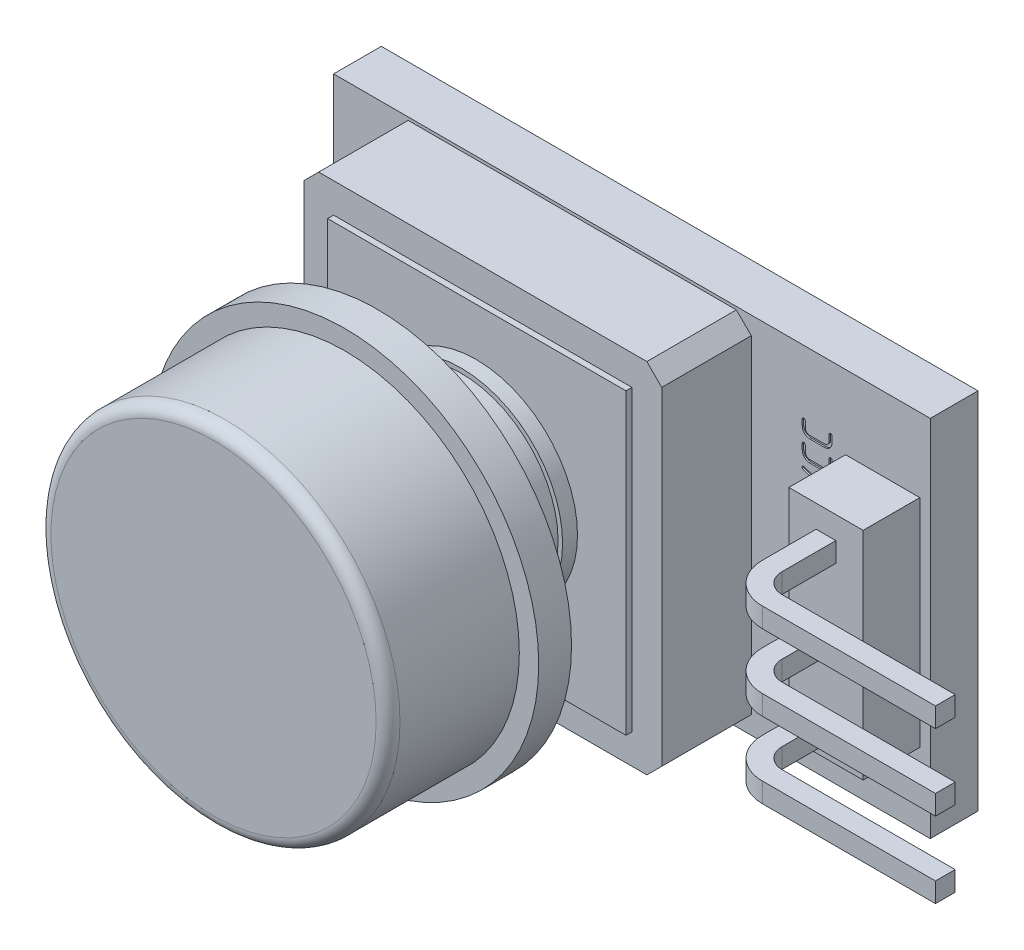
from build123d import *

# Parameters (mm, degrees)
SKETCH1_W           = 20
SKETCH1_H           = 12.2
BOSS_EXTRUDE1_DEPTH = 1.6
SKETCH5_W           = 2.49
SKETCH5_H           = 7.25
BOSS_EXTRUDE3_DEPTH = 1.9
EXTRUDE_THIN1_DEPTH = 0.33
LPATTERN1_COUNT     = 2
LPATTERN1_PITCH     = 2.54
LPATTERN1_2_COUNT   = 2
LPATTERN1_2_PITCH   = 2.54
CUT_EXTRUDE3_DEPTH  = 0.05
BOSS_EXTRU_1_DEPTH  = 3
ESQUISSE2_W         = 10
ESQUISSE2_H         = 10
BOSS_EXTRU_2_DEPTH  = 0.2
ESQUISSE3_R         = 3.4
BOSS_EXTRU_3_DEPTH  = 0.5
ESQUISSE5_W         = 1.960547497
ESQUISSE5_H         = 1.176328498
BOSS_EXTRU_4_DEPTH  = 0.5
BOSS_EXTRU_5_DEPTH  = 0.1


with BuildPart() as part:
    # Sketch1 → Boss-Extrude1 (new body)
    with BuildSketch(Plane.XY):
        with Locations((-3, 0)):
            Rectangle(SKETCH1_W, SKETCH1_H)
    extrude(amount=-BOSS_EXTRUDE1_DEPTH)

    # Sketch14 → Cut-Extrude3 (cut)
    # profile 1 of 9: a face of its own
    with BuildSketch(Plane.XY):
        with BuildLine():
            add(Edge.make_bspline(
                [(3.009027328, -3.554935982), (2.998579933, -3.555520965), (2.978074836, -3.55666911), (2.948035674, -3.561097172), (2.919420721, -3.568303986), (2.892009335, -3.577828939), (2.865997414, -3.590032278), (2.841346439, -3.604814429), (2.81815031, -3.622212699), (2.79635941, -3.641775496), (2.776440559, -3.663190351), (2.759145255, -3.686301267), (2.744161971, -3.710620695), (2.731743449, -3.736280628), (2.721883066, -3.763307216), (2.71490563, -3.791671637), (2.710019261, -3.821307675), (2.709092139, -3.84156936), (2.70862003, -3.851887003)],
                knots=[0, 0, 0, 0, 1.071120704, 2.10228816, 3.103427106, 4.088573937, 5.069289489, 6.04014042, 7.026654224, 8.033736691, 9.035236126, 10.016197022, 10.984715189, 11.955888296, 12.930301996, 13.924712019, 14.943223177, 16, 16, 16, 16], degree=3))
            add(Edge.make_bspline(
                [(2.70862003, -3.851887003), (2.709096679, -3.86220393), (2.710035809, -3.882531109), (2.714879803, -3.912242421), (2.7218881, -3.94066801), (2.731733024, -3.967702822), (2.7442239, -3.99338595), (2.759071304, -4.017858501), (2.776506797, -4.041001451), (2.796352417, -4.062600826), (2.818088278, -4.082378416), (2.841354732, -4.099759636), (2.865989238, -4.114575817), (2.892054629, -4.12669524), (2.91937203, -4.136568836), (2.948063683, -4.143594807), (2.978043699, -4.148450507), (2.998573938, -4.149380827), (3.009026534, -4.149854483)],
                knots=[0, 0, 0, 0, 1.055102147, 2.078840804, 3.071674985, 4.044544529, 5.014178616, 5.987072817, 6.966479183, 7.971488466, 8.981616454, 9.966566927, 10.935879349, 11.915040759, 12.900940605, 13.900493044, 14.931074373, 16, 16, 16, 16], degree=3))
            Line((3.009026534, -4.149854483), (3.407536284, -4.149821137))
            add(Edge.make_bspline(
                [(3.407536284, -4.149821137), (3.417875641, -4.149358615), (3.438225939, -4.148448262), (3.467962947, -4.143603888), (3.49649459, -4.13651489), (3.523682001, -4.126810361), (3.549535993, -4.114401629), (3.574229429, -4.099831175), (3.597512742, -4.082433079), (3.619060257, -4.062530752), (3.638916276, -4.041012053), (3.656322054, -4.017848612), (3.671228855, -3.993439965), (3.683442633, -3.967650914), (3.693273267, -3.940642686), (3.700595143, -3.912275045), (3.705357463, -3.882526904), (3.706308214, -3.862202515), (3.706790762, -3.851887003)],
                knots=[0, 0, 0, 0, 1.059849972, 2.086035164, 3.081242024, 4.069497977, 5.038444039, 6.016033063, 7.003337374, 8.010748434, 9.018159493, 9.999906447, 10.975125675, 11.944071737, 12.919266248, 13.916191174, 14.942376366, 16, 16, 16, 16], degree=3))
            add(Edge.make_bspline(
                [(3.706790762, -3.851887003), (3.706312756, -3.841570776), (3.705374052, -3.821311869), (3.700568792, -3.791639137), (3.693278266, -3.763332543), (3.683432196, -3.736332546), (3.671290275, -3.710566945), (3.656248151, -3.686311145), (3.638982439, -3.663179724), (3.619054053, -3.64184549), (3.597450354, -3.622157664), (3.574237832, -3.604742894), (3.54952781, -3.590206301), (3.523726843, -3.577715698), (3.496446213, -3.568354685), (3.467990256, -3.561099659), (3.438157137, -3.556620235), (3.417780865, -3.55563894), (3.407400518, -3.555139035)],
                knots=[0, 0, 0, 0, 1.059029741, 2.079712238, 3.077962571, 4.054453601, 5.024687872, 5.9952708, 6.978322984, 7.981957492, 8.986025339, 9.974642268, 10.953530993, 11.923765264, 12.911012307, 13.90754229, 14.934032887, 16, 16, 16, 16], degree=3))
            Line((3.407400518, -3.555139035), (3.009027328, -3.554935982))
        make_face()
        with BuildLine():
            add(Edge.make_bspline(
                [(3.407536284, -3.65493618), (3.414340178, -3.655400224), (3.427769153, -3.656316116), (3.447499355, -3.659012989), (3.466427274, -3.66376125), (3.484403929, -3.670301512), (3.501717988, -3.678209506), (3.517990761, -3.688073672), (3.53349917, -3.699504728), (3.548024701, -3.712398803), (3.561250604, -3.726609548), (3.572835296, -3.74189736), (3.5829054, -3.758059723), (3.591243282, -3.775140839), (3.597817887, -3.793122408), (3.602339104, -3.811969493), (3.605828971, -3.831576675), (3.606465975, -3.845028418), (3.606790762, -3.851887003)],
                knots=[0, 0, 0, 0, 1.05399557, 2.080290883, 3.073351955, 4.063759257, 5.033579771, 6.010553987, 6.99913269, 8.007915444, 9.008238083, 9.994706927, 10.968195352, 11.947019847, 12.927579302, 13.920640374, 14.939805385, 16, 16, 16, 16], degree=3))
            add(Edge.make_bspline(
                [(3.606790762, -3.851887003), (3.606465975, -3.858745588), (3.605828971, -3.872197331), (3.602339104, -3.891804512), (3.597817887, -3.910651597), (3.591243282, -3.928633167), (3.5829054, -3.945714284), (3.572835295, -3.961876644), (3.561250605, -3.977164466), (3.548024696, -3.991375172), (3.533499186, -4.004269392), (3.517990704, -4.015699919), (3.501718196, -4.025566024), (3.484403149, -4.0334668), (3.466430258, -4.040034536), (3.447478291, -4.04468078), (3.42775388, -4.04779033), (3.414254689, -4.048485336), (3.407400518, -4.048838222)],
                knots=[0, 0, 0, 0, 1.059681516, 2.078353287, 3.070933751, 4.051018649, 5.029369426, 6.002386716, 6.988378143, 7.98821666, 8.996511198, 9.984611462, 10.961112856, 11.93046401, 12.920391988, 13.912972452, 14.940318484, 16, 16, 16, 16], degree=3))
            Line((3.407400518, -4.048838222), (3.009027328, -4.048668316))
            add(Edge.make_bspline(
                [(3.009027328, -4.048668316), (3.002104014, -4.048387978), (2.98846393, -4.047835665), (2.968547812, -4.044661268), (2.94944136, -4.040081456), (2.93137189, -4.033410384), (2.913933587, -4.025628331), (2.897636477, -4.01568187), (2.882117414, -4.00434167), (2.867804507, -3.991291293), (2.854533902, -3.977242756), (2.843221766, -3.961799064), (2.833080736, -3.945770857), (2.824954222, -3.928623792), (2.818733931, -3.910577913), (2.813736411, -3.891865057), (2.810690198, -3.872169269), (2.809992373, -3.858739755), (2.80963629, -3.851887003)],
                knots=[0, 0, 0, 0, 1.068353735, 2.1048349, 3.106403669, 4.095177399, 5.07289061, 6.048253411, 7.035201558, 8.034530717, 9.033203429, 10.011754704, 10.983637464, 11.956307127, 12.931725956, 13.925736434, 14.941554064, 16, 16, 16, 16], degree=3))
            add(Edge.make_bspline(
                [(2.80963629, -3.851887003), (2.809992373, -3.845034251), (2.810690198, -3.831604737), (2.813736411, -3.811908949), (2.818733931, -3.793196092), (2.824954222, -3.775150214), (2.833080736, -3.758003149), (2.843221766, -3.74197494), (2.854533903, -3.726531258), (2.867804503, -3.712482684), (2.882117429, -3.699432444), (2.897636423, -3.68809174), (2.913933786, -3.678147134), (2.931371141, -3.670358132), (2.949444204, -3.663713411), (2.968527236, -3.659034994), (2.988490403, -3.656254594), (3.002107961, -3.655514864), (3.009026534, -3.655139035)],
                knots=[0, 0, 0, 0, 1.058512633, 2.074394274, 3.068467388, 4.043947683, 5.016678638, 5.98862264, 6.967235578, 7.965971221, 8.965363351, 9.95237369, 10.927797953, 11.905572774, 12.894408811, 13.896040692, 14.9310569, 16, 16, 16, 16], degree=3))
            Line((3.009026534, -3.655139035), (3.407536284, -3.65493618))
        make_face(mode=Mode.SUBTRACT)
    # profile 2 of 9: a face of its own
    with BuildSketch(Plane.XY):
        with BuildLine():
            add(Edge.make_bspline(
                [(2.758283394, -2.748431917), (2.754791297, -2.748731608), (2.748069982, -2.749308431), (2.738425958, -2.751896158), (2.730002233, -2.756587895), (2.722411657, -2.762446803), (2.716063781, -2.769712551), (2.711615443, -2.778239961), (2.708539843, -2.78765707), (2.708191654, -2.794340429), (2.708010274, -2.797821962)],
                knots=[0, 0, 0, 0, 1.072902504, 2.065038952, 3.030772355, 4.00649063, 4.992529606, 5.958263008, 6.936406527, 8, 8, 8, 8], degree=3))
            add(Edge.make_bspline(
                [(2.708010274, -2.797821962), (2.708206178, -2.801300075), (2.708589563, -2.808106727), (2.711571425, -2.817745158), (2.716047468, -2.826546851), (2.722476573, -2.833969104), (2.729861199, -2.84032898), (2.73847856, -2.844890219), (2.74800401, -2.84782315), (2.754736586, -2.848358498), (2.758213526, -2.84863497)],
                knots=[0, 0, 0, 0, 1.050622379, 2.056063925, 3.028133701, 4.017773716, 5.00741373, 5.961369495, 6.947179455, 8, 8, 8, 8], degree=3))
            Line((2.758213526, -2.84863497), (3.407224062, -2.848432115))
            add(Edge.make_bspline(
                [(3.407224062, -2.848432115), (3.414064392, -2.848894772), (3.427530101, -2.849805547), (3.447296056, -2.852509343), (3.466224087, -2.857257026), (3.484200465, -2.863797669), (3.501515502, -2.871704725), (3.517784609, -2.881572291), (3.533306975, -2.892990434), (3.547813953, -2.905964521), (3.561264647, -2.920030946), (3.572810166, -2.935410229), (3.582948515, -2.951500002), (3.59100796, -2.968689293), (3.597567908, -2.986643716), (3.602402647, -3.005432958), (3.605811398, -3.02507682), (3.606460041, -3.038525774), (3.606790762, -3.045382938)],
                knots=[0, 0, 0, 0, 1.058877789, 2.084481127, 3.076872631, 4.066612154, 5.03577877, 6.012094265, 7.000006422, 8.008109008, 9.01490717, 10.000710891, 10.973542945, 11.947162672, 12.927060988, 13.922042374, 14.940520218, 16, 16, 16, 16], degree=3))
            add(Edge.make_bspline(
                [(3.606790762, -3.045382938), (3.606460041, -3.052240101), (3.605811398, -3.065689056), (3.602402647, -3.085332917), (3.597567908, -3.104122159), (3.59100796, -3.122076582), (3.582948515, -3.139265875), (3.572810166, -3.155355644), (3.561264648, -3.170734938), (3.547813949, -3.184801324), (3.533306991, -3.197775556), (3.517784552, -3.209193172), (3.50151571, -3.219062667), (3.484199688, -3.226962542), (3.466227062, -3.233530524), (3.447275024, -3.2381767), (3.427550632, -3.241286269), (3.414051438, -3.241981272), (3.407197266, -3.242334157)],
                knots=[0, 0, 0, 0, 1.059337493, 2.077678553, 3.072526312, 4.052293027, 5.025781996, 5.998483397, 6.984154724, 7.990817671, 8.998784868, 9.986564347, 10.962748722, 11.931785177, 12.921391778, 13.913650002, 14.940662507, 16, 16, 16, 16], degree=3))
            Line((3.407197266, -3.242334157), (2.758283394, -3.242164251))
            add(Edge.make_bspline(
                [(2.758283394, -3.242164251), (2.754782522, -3.242424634), (2.748024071, -3.242927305), (2.738478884, -3.245877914), (2.729860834, -3.250436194), (2.722477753, -3.256797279), (2.716043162, -3.264217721), (2.711616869, -3.272967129), (2.708561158, -3.282513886), (2.708197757, -3.289260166), (2.708010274, -3.292740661)],
                knots=[0, 0, 0, 0, 1.06116171, 2.048578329, 3.004088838, 3.995341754, 4.986594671, 5.960248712, 6.947665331, 8, 8, 8, 8], degree=3))
            add(Edge.make_bspline(
                [(2.708010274, -3.292740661), (2.708206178, -3.29621878), (2.708589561, -3.303025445), (2.711571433, -3.312663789), (2.716047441, -3.3214658), (2.722476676, -3.328886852), (2.729860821, -3.335251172), (2.738479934, -3.339796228), (2.747991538, -3.342790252), (2.75473466, -3.343159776), (2.758213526, -3.343350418)],
                knots=[0, 0, 0, 0, 1.050911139, 2.056629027, 3.028965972, 4.018877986, 5.008789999, 5.963007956, 6.949088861, 8, 8, 8, 8], degree=3))
            Line((2.758213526, -3.343350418), (3.407224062, -3.343317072))
            add(Edge.make_bspline(
                [(3.407224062, -3.343317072), (3.417599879, -3.342856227), (3.437986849, -3.341950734), (3.467759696, -3.337099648), (3.49629132, -3.330010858), (3.523478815, -3.320306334), (3.549332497, -3.307897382), (3.574027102, -3.29332781), (3.597305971, -3.275926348), (3.618870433, -3.25603686), (3.638691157, -3.234440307), (3.656346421, -3.211414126), (3.671216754, -3.186926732), (3.683445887, -3.161149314), (3.693272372, -3.134137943), (3.700595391, -3.105771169), (3.705357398, -3.076022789), (3.706308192, -3.055698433), (3.706790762, -3.045382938)],
                knots=[0, 0, 0, 0, 1.063039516, 2.088718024, 3.083433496, 4.071201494, 5.039669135, 6.01677547, 7.003592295, 8.010505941, 9.017419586, 10.00286902, 10.977606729, 11.946074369, 12.920787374, 13.917220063, 14.942898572, 16, 16, 16, 16], degree=3))
            add(Edge.make_bspline(
                [(3.706790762, -3.045382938), (3.706312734, -3.035066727), (3.705373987, -3.014807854), (3.700569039, -2.985134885), (3.693277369, -2.956829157), (3.683435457, -2.929826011), (3.67127818, -2.90407204), (3.656272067, -2.879737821), (3.638757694, -2.856743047), (3.618864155, -2.835331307), (3.597243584, -2.815656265), (3.574035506, -2.798238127), (3.549324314, -2.783702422), (3.523523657, -2.771211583), (3.496242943, -2.761850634), (3.467787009, -2.75459559), (3.437953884, -2.750116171), (3.417577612, -2.749134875), (3.407197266, -2.74863497)],
                knots=[0, 0, 0, 0, 1.058752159, 2.079167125, 3.077155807, 4.053390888, 5.023370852, 5.99369938, 6.980687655, 7.984059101, 8.987863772, 9.976221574, 10.954853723, 11.924833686, 12.911821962, 13.908090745, 14.934312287, 16, 16, 16, 16], degree=3))
            Line((3.407197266, -2.74863497), (2.758283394, -2.748431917))
        make_face()
    # profile 3 of 9: a face of its own
    with BuildSketch(Plane.XY):
        with BuildLine():
            add(Edge.make_bspline(
                [(2.754895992, -2.542586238), (2.758329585, -2.542374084), (2.765026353, -2.541960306), (2.774531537, -2.53893383), (2.783283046, -2.534504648), (2.790694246, -2.528066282), (2.797129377, -2.520655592), (2.801570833, -2.511905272), (2.804565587, -2.502345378), (2.80509473, -2.495609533), (2.805367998, -2.492130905)],
                knots=[0, 0, 0, 0, 1.039221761, 2.026864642, 3.000741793, 3.99222185, 4.983701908, 5.957579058, 6.94522194, 8, 8, 8, 8], degree=3))
            Line((2.805367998, -2.492130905), (2.805472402, -2.291109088))
            Line((2.805472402, -2.291109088), (3.658246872, -2.291109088))
            add(Edge.make_bspline(
                [(3.658246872, -2.291109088), (3.661716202, -2.290922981), (3.668451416, -2.290561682), (3.677986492, -2.287507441), (3.68673842, -2.283082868), (3.694149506, -2.276643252), (3.700584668, -2.269232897), (3.705026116, -2.260482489), (3.708020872, -2.250922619), (3.708550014, -2.24418677), (3.708823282, -2.240708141)],
                knots=[0, 0, 0, 0, 1.047864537, 2.034281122, 3.006949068, 3.997198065, 4.987447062, 5.960115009, 6.946531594, 8, 8, 8, 8], degree=3))
            add(Edge.make_bspline(
                [(3.708823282, -2.240708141), (3.708541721, -2.237231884), (3.707991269, -2.230435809), (3.705071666, -2.220784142), (3.700580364, -2.2119814), (3.694150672, -2.204569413), (3.686738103, -2.198130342), (3.677986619, -2.19370523), (3.66844042, -2.190649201), (3.661694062, -2.190285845), (3.658213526, -2.190098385)],
                knots=[0, 0, 0, 0, 1.05044208, 2.053612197, 3.023485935, 4.010890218, 4.998294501, 5.968168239, 6.95175112, 8, 8, 8, 8], degree=3))
            Line((3.658213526, -2.190098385), (2.805472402, -2.189956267))
            Line((2.805472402, -2.189956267), (2.805472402, -1.989055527))
            add(Edge.make_bspline(
                [(2.805472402, -1.989055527), (2.805747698, -1.985465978), (2.806272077, -1.97862867), (2.804271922, -1.968810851), (2.800645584, -1.959908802), (2.794610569, -1.952483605), (2.78727674, -1.946351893), (2.778853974, -1.941808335), (2.769353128, -1.939071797), (2.76270376, -1.938678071), (2.759229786, -1.938472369)],
                knots=[0, 0, 0, 0, 1.099227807, 2.093789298, 3.04347335, 4.020508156, 4.994443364, 5.961479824, 6.934971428, 8, 8, 8, 8], degree=3))
            add(Edge.make_bspline(
                [(2.759229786, -1.938472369), (2.755759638, -1.938692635), (2.748987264, -1.939122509), (2.739254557, -1.941751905), (2.73064553, -1.946361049), (2.723025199, -1.952291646), (2.716672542, -1.959547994), (2.712225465, -1.968077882), (2.709149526, -1.977494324), (2.708801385, -1.984177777), (2.70862003, -1.987659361)],
                knots=[0, 0, 0, 0, 1.059749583, 2.068216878, 3.048731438, 4.020923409, 5.003398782, 5.965641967, 6.940250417, 8, 8, 8, 8], degree=3))
            Line((2.70862003, -1.987659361), (2.708653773, -2.490559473))
            add(Edge.make_bspline(
                [(2.708653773, -2.490559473), (2.708822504, -2.494090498), (2.709147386, -2.500889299), (2.712229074, -2.510481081), (2.71665139, -2.51923276), (2.72309122, -2.526645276), (2.730503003, -2.533074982), (2.739305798, -2.53756628), (2.748957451, -2.540485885), (2.755753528, -2.541036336), (2.759229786, -2.541317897)],
                knots=[0, 0, 0, 0, 1.060887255, 2.042681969, 3.010792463, 3.996401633, 4.982010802, 5.950121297, 6.951467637, 8, 8, 8, 8], degree=3))
            Line((2.759229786, -2.541317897), (2.754895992, -2.542586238))
        make_face()
    # profile 4 of 9: a face of its own
    with BuildSketch(Plane.XY):
        with BuildLine():
            add(Edge.make_bspline(
                [(3.609075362, -0.886231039), (3.608263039, -0.896447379), (3.60667633, -0.916402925), (3.59830533, -0.945047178), (3.584040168, -0.970635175), (3.565348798, -0.993238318), (3.542655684, -1.011903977), (3.516751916, -1.025873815), (3.487852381, -1.034360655), (3.467619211, -1.035867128), (3.457197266, -1.0366431)],
                knots=[0, 0, 0, 0, 1.035947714, 2.023513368, 2.993651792, 3.982645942, 4.976931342, 5.949830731, 6.943974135, 8, 8, 8, 8], degree=3))
            Line((3.457197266, -1.0366431), (2.955796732, -1.036555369))
            add(Edge.make_bspline(
                [(2.955796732, -1.036555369), (2.945435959, -1.035809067), (2.925262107, -1.034355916), (2.896470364, -1.025911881), (2.87070945, -1.011896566), (2.848244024, -0.993219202), (2.82967499, -0.970685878), (2.815987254, -0.944929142), (2.807426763, -0.916435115), (2.806064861, -0.896458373), (2.805367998, -0.886236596)],
                knots=[0, 0, 0, 0, 1.05354528, 2.051397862, 3.021863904, 4.01454802, 5.002852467, 5.970064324, 6.961314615, 8, 8, 8, 8], degree=3))
            Line((2.805367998, -0.886236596), (2.805472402, -0.584177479))
            add(Edge.make_bspline(
                [(2.805472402, -0.584177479), (2.805142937, -0.580780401), (2.80449848, -0.574135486), (2.80167547, -0.564716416), (2.797046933, -0.556249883), (2.790693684, -0.54907279), (2.783270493, -0.542820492), (2.774479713, -0.538662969), (2.764991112, -0.535554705), (2.758240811, -0.535200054), (2.754758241, -0.535017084)],
                knots=[0, 0, 0, 0, 1.043813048, 2.04176904, 2.989240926, 3.975255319, 4.963887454, 5.938477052, 6.936433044, 8, 8, 8, 8], degree=3))
            add(Edge.make_bspline(
                [(2.754758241, -0.535017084), (2.751275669, -0.535200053), (2.744525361, -0.535554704), (2.735036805, -0.538662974), (2.726245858, -0.542820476), (2.718823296, -0.549072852), (2.71246773, -0.556249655), (2.707847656, -0.564717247), (2.704989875, -0.574136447), (2.704433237, -0.580796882), (2.704148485, -0.584204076)],
                knots=[0, 0, 0, 0, 1.063384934, 2.061170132, 3.035592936, 4.024055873, 5.009901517, 5.95721125, 6.954996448, 8, 8, 8, 8], degree=3))
            Line((2.704148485, -0.584204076), (2.704319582, -0.886231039))
            add(Edge.make_bspline(
                [(2.704319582, -0.886231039), (2.704698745, -0.894921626), (2.705442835, -0.911976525), (2.709508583, -0.936912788), (2.715214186, -0.96089935), (2.723787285, -0.983626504), (2.733793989, -1.005563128), (2.746407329, -1.026136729), (2.760809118, -1.045792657), (2.777474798, -1.063929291), (2.795666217, -1.080581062), (2.815248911, -1.095209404), (2.835843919, -1.1079718), (2.85767695, -1.118334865), (2.880645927, -1.126488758), (2.904652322, -1.132598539), (2.92984362, -1.136501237), (2.947021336, -1.13740307), (2.955774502, -1.137862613)],
                knots=[0, 0, 0, 0, 1.056907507, 2.074134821, 3.067221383, 4.049829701, 5.022858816, 5.994945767, 6.978658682, 7.981741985, 8.984825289, 9.973459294, 10.949830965, 11.926376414, 12.906183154, 13.909266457, 14.934635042, 16, 16, 16, 16], degree=3))
            Line((2.955774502, -1.137862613), (3.457346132, -1.137708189))
            add(Edge.make_bspline(
                [(3.457346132, -1.137708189), (3.466050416, -1.13731179), (3.483183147, -1.136531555), (3.508318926, -1.132588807), (3.532325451, -1.126490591), (3.555296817, -1.118336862), (3.577120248, -1.107962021), (3.597705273, -1.09527516), (3.61711215, -1.080506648), (3.635314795, -1.063948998), (3.651933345, -1.04572251), (3.666595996, -1.026208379), (3.6791428, -1.005546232), (3.689262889, -0.983678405), (3.697426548, -0.960819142), (3.703561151, -0.936954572), (3.707461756, -0.911965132), (3.708363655, -0.8949221), (3.708823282, -0.886236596)],
                knots=[0, 0, 0, 0, 1.059498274, 2.085421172, 3.089046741, 4.069383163, 5.046456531, 6.023356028, 7.005942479, 8.009568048, 9.013193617, 10.002362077, 10.974974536, 11.94852967, 12.928866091, 13.924504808, 14.942282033, 16, 16, 16, 16], degree=3))
            Line((3.708823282, -0.886236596), (3.708823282, -0.584177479))
            add(Edge.make_bspline(
                [(3.708823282, -0.584177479), (3.708537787, -0.580779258), (3.707978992, -0.574127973), (3.705124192, -0.564717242), (3.700504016, -0.556249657), (3.694148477, -0.549072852), (3.686725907, -0.542820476), (3.677934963, -0.538662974), (3.668446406, -0.535554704), (3.661696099, -0.535200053), (3.658213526, -0.535017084)],
                knots=[0, 0, 0, 0, 1.042658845, 2.040780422, 2.988409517, 3.974587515, 4.963383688, 5.938134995, 6.936256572, 8, 8, 8, 8], degree=3))
            Line((3.658213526, -0.535017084), (3.156697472, -0.535005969))
            add(Edge.make_bspline(
                [(3.156697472, -0.535005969), (3.153177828, -0.535190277), (3.146390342, -0.535545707), (3.136865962, -0.538662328), (3.128075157, -0.54282065), (3.120652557, -0.549072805), (3.114297, -0.556249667), (3.109676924, -0.564717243), (3.106819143, -0.574136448), (3.106262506, -0.580796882), (3.105977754, -0.584204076)],
                knots=[0, 0, 0, 0, 1.073155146, 2.069534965, 3.042585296, 4.029655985, 5.014113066, 5.960088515, 6.956468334, 8, 8, 8, 8], degree=3))
            Line((3.105977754, -0.584204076), (3.106121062, -0.735906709))
            add(Edge.make_bspline(
                [(3.106121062, -0.735906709), (3.106323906, -0.739430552), (3.106710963, -0.746154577), (3.109782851, -0.755615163), (3.114234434, -0.764144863), (3.12058617, -0.771400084), (3.128205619, -0.777335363), (3.13676123, -0.78189575), (3.146404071, -0.784597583), (3.15311527, -0.785007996), (3.15658751, -0.785220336)],
                knots=[0, 0, 0, 0, 1.07404972, 2.049449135, 3.012473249, 3.995745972, 4.968726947, 5.950037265, 6.939390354, 8, 8, 8, 8], degree=3))
            add(Edge.make_bspline(
                [(3.15658751, -0.785220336), (3.160059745, -0.785007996), (3.166770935, -0.784597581), (3.176413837, -0.781895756), (3.184969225, -0.777335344), (3.192589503, -0.771400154), (3.198938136, -0.764144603), (3.203401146, -0.755616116), (3.206417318, -0.746186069), (3.206929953, -0.739512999), (3.207197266, -0.736033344)],
                knots=[0, 0, 0, 0, 1.062099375, 2.052842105, 3.035530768, 4.009878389, 4.994532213, 5.958908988, 6.935678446, 8, 8, 8, 8], degree=3))
            Line((3.207197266, -0.736033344), (3.213058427, -0.63377415))
            Line((3.213058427, -0.63377415), (3.606790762, -0.63377415))
            Line((3.606790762, -0.63377415), (3.609075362, -0.886231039))
        make_face()
    # profile 5 of 9: a face of its own
    with BuildSketch(Plane.XY):
        with BuildLine():
            add(Edge.make_bspline(
                [(2.758395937, 0.269454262), (2.75493266, 0.26915554), (2.748239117, 0.268578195), (2.738589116, 0.265939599), (2.730035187, 0.261362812), (2.722415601, 0.255431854), (2.716062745, 0.248175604), (2.71161572, 0.239645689), (2.708539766, 0.230229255), (2.708191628, 0.2235458), (2.708010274, 0.220064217)],
                knots=[0, 0, 0, 0, 1.062489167, 2.053493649, 3.036441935, 4.011046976, 4.995960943, 5.960592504, 6.937620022, 8, 8, 8, 8], degree=3))
            add(Edge.make_bspline(
                [(2.708010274, 0.220064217), (2.708206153, 0.216586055), (2.708589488, 0.209779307), (2.711571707, 0.200141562), (2.716046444, 0.191337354), (2.72248048, 0.1839246), (2.729892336, 0.177490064), (2.738642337, 0.173047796), (2.748137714, 0.17007602), (2.754803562, 0.16953035), (2.758213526, 0.169251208)],
                knots=[0, 0, 0, 0, 1.050917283, 2.056641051, 3.028983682, 4.018901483, 5.008819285, 5.981161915, 6.967248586, 8, 8, 8, 8], degree=3))
            Line((2.758213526, 0.169251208), (3.464663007, 0.169454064))
            Line((3.464663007, 0.169454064), (2.73462061, -0.229897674))
            add(Edge.make_bspline(
                [(2.73462061, -0.229897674), (2.730573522, -0.23254145), (2.72282417, -0.237603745), (2.714500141, -0.248530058), (2.708977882, -0.261018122), (2.708341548, -0.27011741), (2.708010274, -0.274854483)],
                knots=[0, 0, 0, 0, 1.052270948, 2.014885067, 2.966552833, 4, 4, 4, 4], degree=3))
            add(Edge.make_bspline(
                [(2.708010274, -0.274854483), (2.708206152, -0.27833265), (2.708589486, -0.285139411), (2.711571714, -0.294777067), (2.716046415, -0.303581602), (2.722480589, -0.310993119), (2.729891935, -0.317432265), (2.738643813, -0.321857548), (2.74812489, -0.324892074), (2.754801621, -0.325270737), (2.758213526, -0.325464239)],
                knots=[0, 0, 0, 0, 1.051211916, 2.057217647, 3.029832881, 4.020028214, 5.010223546, 5.982838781, 6.969201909, 8, 8, 8, 8], degree=3))
            Line((2.758213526, -0.325464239), (3.657662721, -0.325430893))
            add(Edge.make_bspline(
                [(3.657662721, -0.325430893), (3.66112197, -0.325252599), (3.667846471, -0.324906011), (3.677337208, -0.321907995), (3.685956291, -0.317365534), (3.693341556, -0.311000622), (3.699766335, -0.30357928), (3.704258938, -0.294779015), (3.707178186, -0.285126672), (3.707728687, -0.278330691), (3.708010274, -0.274854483)],
                knots=[0, 0, 0, 0, 1.045195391, 2.0317752, 2.986475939, 3.976888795, 4.967301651, 5.940130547, 6.946357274, 8, 8, 8, 8], degree=3))
            add(Edge.make_bspline(
                [(3.708010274, -0.274854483), (3.707736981, -0.271375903), (3.707207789, -0.26464015), (3.704213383, -0.2550796), (3.699770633, -0.246331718), (3.69334041, -0.238911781), (3.685956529, -0.232547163), (3.677337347, -0.228002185), (3.667825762, -0.225008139), (3.661082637, -0.224638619), (3.65760377, -0.224447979)],
                knots=[0, 0, 0, 0, 1.055410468, 2.043645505, 3.018106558, 4.010181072, 5.002255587, 5.958558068, 6.946793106, 8, 8, 8, 8], degree=3))
            Line((3.65760377, -0.224447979), (2.951395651, -0.224278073))
            Line((2.951395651, -0.224278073), (3.678640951, 0.173679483))
            add(Edge.make_bspline(
                [(3.678640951, 0.173679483), (3.682775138, 0.176120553), (3.690863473, 0.180896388), (3.700071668, 0.191798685), (3.706267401, 0.205064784), (3.707411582, 0.214911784), (3.708010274, 0.220064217)],
                knots=[0, 0, 0, 0, 0.994501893, 1.945694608, 2.925086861, 4, 4, 4, 4], degree=3))
            add(Edge.make_bspline(
                [(3.708010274, 0.220064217), (3.707742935, 0.223543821), (3.707230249, 0.230216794), (3.704214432, 0.239647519), (3.699750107, 0.248173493), (3.693406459, 0.255438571), (3.68581518, 0.261301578), (3.677390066, 0.265977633), (3.667782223, 0.268618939), (3.66107431, 0.269035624), (3.65760377, 0.269251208)],
                knots=[0, 0, 0, 0, 1.06676336, 2.045773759, 3.012363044, 3.999275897, 4.975858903, 5.942448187, 6.935463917, 8, 8, 8, 8], degree=3))
            Line((3.65760377, 0.269251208), (2.758395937, 0.269454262))
        make_face()
    # profile 6 of 9: a face of its own
    with BuildSketch(Plane.XY):
        with BuildLine():
            add(Edge.make_bspline(
                [(3.656085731, 0.481073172), (3.659527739, 0.481258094), (3.666299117, 0.481621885), (3.675900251, 0.484603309), (3.684704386, 0.489075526), (3.692118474, 0.495509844), (3.698547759, 0.502923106), (3.703039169, 0.51172551), (3.705958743, 0.52137727), (3.706509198, 0.528173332), (3.706790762, 0.531649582)],
                knots=[0, 0, 0, 0, 1.036014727, 2.038126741, 3.006977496, 3.993340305, 4.979703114, 5.948553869, 6.950665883, 8, 8, 8, 8], degree=3))
            Line((3.706790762, 0.531649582), (3.706790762, 0.828657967))
            add(Edge.make_bspline(
                [(3.706790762, 0.828657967), (3.70633299, 0.837122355), (3.705430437, 0.853810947), (3.70146862, 0.87827548), (3.69563295, 0.901786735), (3.687521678, 0.924233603), (3.676955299, 0.945504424), (3.664628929, 0.965860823), (3.650040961, 0.985118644), (3.633479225, 1.003064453), (3.615278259, 1.019420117), (3.595872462, 1.033992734), (3.575323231, 1.046411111), (3.553673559, 1.056659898), (3.53086426, 1.064535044), (3.507042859, 1.070722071), (3.481981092, 1.074628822), (3.464866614, 1.075376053), (3.456181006, 1.075755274)],
                knots=[0, 0, 0, 0, 1.042030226, 2.054491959, 3.042831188, 4.018227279, 4.983496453, 5.959639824, 6.941316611, 7.949792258, 8.958818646, 9.947157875, 10.930425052, 11.907101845, 12.887539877, 13.894085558, 14.931247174, 16, 16, 16, 16], degree=3))
            Line((3.456181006, 1.075755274), (2.958865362, 1.075958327))
            add(Edge.make_bspline(
                [(2.958865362, 1.075958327), (2.950166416, 1.075497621), (2.933110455, 1.074594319), (2.908098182, 1.070716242), (2.884288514, 1.064494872), (2.861387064, 1.056699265), (2.839714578, 1.046464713), (2.81930745, 1.033927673), (2.799923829, 1.019428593), (2.781730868, 1.003061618), (2.765161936, 0.985121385), (2.750594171, 0.965852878), (2.738210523, 0.945558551), (2.72792184, 0.924181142), (2.719821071, 0.90176139), (2.713689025, 0.878307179), (2.709739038, 0.853796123), (2.708996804, 0.837084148), (2.70862003, 0.828600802)],
                knots=[0, 0, 0, 0, 1.071361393, 2.100610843, 3.107472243, 4.096086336, 5.073069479, 6.049519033, 7.03816827, 8.047511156, 9.056303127, 10.038287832, 11.014737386, 11.976668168, 12.952370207, 13.943090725, 14.955870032, 16, 16, 16, 16], degree=3))
            Line((2.70862003, 0.828600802), (2.708653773, 0.531649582))
            add(Edge.make_bspline(
                [(2.708653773, 0.531649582), (2.708835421, 0.528171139), (2.709190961, 0.521362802), (2.712183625, 0.511727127), (2.716655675, 0.502922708), (2.723090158, 0.495509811), (2.730502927, 0.489076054), (2.739307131, 0.484601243), (2.748944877, 0.481619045), (2.755751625, 0.481235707), (2.759229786, 0.481039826)],
                knots=[0, 0, 0, 0, 1.045691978, 2.046726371, 3.014535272, 3.999837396, 4.985139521, 5.952948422, 6.953982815, 8, 8, 8, 8], degree=3))
            Line((2.759229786, 0.481039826), (3.656085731, 0.481073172))
        make_face()
        with BuildLine():
            add(Edge.make_bspline(
                [(2.809806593, 0.828657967), (2.810434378, 0.838659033), (2.811662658, 0.858226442), (2.82025591, 0.886108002), (2.834025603, 0.911213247), (2.852291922, 0.933297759), (2.874487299, 0.951737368), (2.900046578, 0.965342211), (2.928582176, 0.973682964), (2.948536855, 0.975050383), (2.958823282, 0.975755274)],
                knots=[0, 0, 0, 0, 1.031322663, 2.017816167, 2.981522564, 3.969872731, 4.958222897, 5.940395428, 6.938295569, 8, 8, 8, 8], degree=3))
            Line((2.958823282, 0.975755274), (3.456304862, 0.975958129))
            add(Edge.make_bspline(
                [(3.456304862, 0.975958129), (3.466546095, 0.975157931), (3.486509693, 0.973598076), (3.515158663, 0.965365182), (3.540945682, 0.951689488), (3.563481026, 0.933307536), (3.58223847, 0.911346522), (3.595904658, 0.886057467), (3.604797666, 0.858241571), (3.606116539, 0.838627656), (3.606790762, 0.828600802)],
                knots=[0, 0, 0, 0, 1.053772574, 2.054156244, 3.038344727, 4.033310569, 5.026423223, 5.986071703, 6.970457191, 8, 8, 8, 8], degree=3))
            Line((3.606790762, 0.828600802), (3.606790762, 0.582225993))
            Line((3.606790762, 0.582225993), (2.809806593, 0.582225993))
            Line((2.809806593, 0.582225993), (2.809806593, 0.828657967))
        make_face(mode=Mode.SUBTRACT)
    # profile 7 of 9: a face of its own
    with BuildSketch(Plane.XY):
        with BuildLine():
            Line((3.500085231, 2.23280796), (2.737224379, 1.977116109))
            add(Edge.make_bspline(
                [(2.737224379, 1.977116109), (2.734010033, 1.975819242), (2.727847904, 1.973333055), (2.719614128, 1.968001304), (2.713261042, 1.961008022), (2.708114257, 1.953185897), (2.7048231, 1.944281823), (2.703512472, 1.93489131), (2.703558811, 1.925004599), (2.705282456, 1.918550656), (2.706181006, 1.915186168)],
                knots=[0, 0, 0, 0, 1.075446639, 2.061707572, 3.014402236, 3.989148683, 4.954538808, 5.933590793, 6.922765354, 8, 8, 8, 8], degree=3))
            add(Edge.make_bspline(
                [(2.706181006, 1.915186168), (2.707491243, 1.912012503), (2.710030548, 1.905861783), (2.715651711, 1.89773119), (2.722631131, 1.891118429), (2.730866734, 1.886270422), (2.73988421, 1.882915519), (2.749487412, 1.881632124), (2.759506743, 1.88165178), (2.766027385, 1.883393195), (2.769392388, 1.884291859)],
                knots=[0, 0, 0, 0, 1.051059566, 2.037005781, 3.007493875, 3.977091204, 4.950246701, 5.937944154, 6.935868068, 8, 8, 8, 8], degree=3))
            Line((2.769392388, 1.884291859), (3.674292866, 2.185041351))
            add(Edge.make_bspline(
                [(3.674292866, 2.185041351), (3.679432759, 2.18702222), (3.689219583, 2.190793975), (3.700468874, 2.201920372), (3.707110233, 2.216375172), (3.707699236, 2.227036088), (3.708010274, 2.232665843)],
                knots=[0, 0, 0, 0, 1.040083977, 1.980414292, 2.933508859, 4, 4, 4, 4], degree=3))
            add(Edge.make_bspline(
                [(3.708010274, 2.232665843), (3.707699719, 2.238160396), (3.70711177, 2.248562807), (3.700455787, 2.262658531), (3.689080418, 2.273299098), (3.67939989, 2.277030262), (3.674270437, 2.279007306)],
                knots=[0, 0, 0, 0, 1.058680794, 2.004318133, 2.942541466, 4, 4, 4, 4], degree=3))
            Line((3.674270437, 2.279007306), (2.769537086, 2.58122323))
            add(Edge.make_bspline(
                [(2.769537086, 2.58122323), (2.766120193, 2.582043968), (2.759530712, 2.583626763), (2.749490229, 2.583713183), (2.73988347, 2.582412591), (2.73086693, 2.579062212), (2.722631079, 2.574213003), (2.715651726, 2.567600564), (2.710030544, 2.559469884), (2.707491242, 2.553319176), (2.706181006, 2.550145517)],
                knots=[0, 0, 0, 0, 1.073341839, 2.069940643, 3.056326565, 4.028189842, 4.996499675, 5.965699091, 6.950336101, 8, 8, 8, 8], degree=3))
            add(Edge.make_bspline(
                [(2.706181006, 2.550145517), (2.705284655, 2.546644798), (2.703561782, 2.539916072), (2.703491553, 2.529762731), (2.704848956, 2.520176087), (2.708118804, 2.511149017), (2.713187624, 2.503114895), (2.719682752, 2.496141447), (2.727714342, 2.490556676), (2.73389743, 2.488163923), (2.737075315, 2.486934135)],
                knots=[0, 0, 0, 0, 1.102855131, 2.119796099, 3.085264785, 4.056735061, 5.035490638, 5.974967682, 6.959206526, 8, 8, 8, 8], degree=3))
            Line((2.737075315, 2.486934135), (3.500085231, 2.23280796))
        make_face()
    # profile 8 of 9: a face of its own
    with BuildSketch(Plane.XY):
        with BuildLine():
            add(Edge.make_bspline(
                [(2.708653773, 3.034989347), (2.709011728, 3.026273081), (2.709713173, 3.009192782), (2.713694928, 2.984184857), (2.719808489, 2.960318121), (2.727981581, 2.937462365), (2.738084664, 2.915582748), (2.750669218, 2.894999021), (2.76508044, 2.87534769), (2.781737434, 2.857202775), (2.799913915, 2.840615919), (2.819312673, 2.825945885), (2.839643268, 2.813108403), (2.861486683, 2.80308265), (2.88416185, 2.794550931), (2.908146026, 2.788826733), (2.933088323, 2.784817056), (2.95013561, 2.783930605), (2.958823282, 2.783478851)],
                knots=[0, 0, 0, 0, 1.063105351, 2.083249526, 3.081203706, 4.063820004, 5.039639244, 6.014513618, 7.001047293, 8.0070069, 9.012966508, 9.997838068, 10.969977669, 11.938317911, 12.923743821, 13.919678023, 14.939822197, 16, 16, 16, 16], degree=3))
            Line((2.958823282, 2.783478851), (3.456304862, 2.783512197))
            add(Edge.make_bspline(
                [(3.456304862, 2.783512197), (3.46495085, 2.783955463), (3.482023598, 2.784830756), (3.506995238, 2.788810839), (3.530991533, 2.794513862), (3.553573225, 2.803121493), (3.575394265, 2.813161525), (3.595868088, 2.825880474), (3.61528805, 2.84062447), (3.633472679, 2.85719994), (3.650122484, 2.875350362), (3.66455383, 2.894991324), (3.677081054, 2.915635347), (3.687462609, 2.937411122), (3.695645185, 2.960293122), (3.701464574, 2.984215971), (3.705446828, 3.009168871), (3.706337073, 3.026214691), (3.706790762, 3.034901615)],
                knots=[0, 0, 0, 0, 1.05500121, 2.083251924, 3.079129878, 4.056745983, 5.025031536, 6.004147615, 6.988963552, 7.994866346, 9.000769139, 9.987247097, 10.962066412, 11.941356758, 12.923917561, 13.919795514, 14.939882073, 16, 16, 16, 16], degree=3))
            Line((3.706790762, 3.034901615), (3.706790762, 3.235890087))
            add(Edge.make_bspline(
                [(3.706790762, 3.235890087), (3.706504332, 3.239307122), (3.705939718, 3.246042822), (3.703039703, 3.255638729), (3.698547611, 3.264441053), (3.692118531, 3.271854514), (3.684704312, 3.27828812), (3.675900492, 3.282762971), (3.666262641, 3.285745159), (3.659455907, 3.286128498), (3.655977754, 3.286324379)],
                knots=[0, 0, 0, 0, 1.032641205, 2.035554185, 3.005179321, 3.992330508, 4.979481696, 5.949106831, 6.952019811, 8, 8, 8, 8], degree=3))
            add(Edge.make_bspline(
                [(3.655977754, 3.286324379), (3.65249617, 3.286143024), (3.645812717, 3.285794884), (3.636396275, 3.282718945), (3.627866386, 3.278271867), (3.620610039, 3.271919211), (3.614679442, 3.26429888), (3.610070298, 3.255689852), (3.607440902, 3.245957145), (3.607011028, 3.239184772), (3.606790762, 3.235714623)],
                knots=[0, 0, 0, 0, 1.059749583, 2.034358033, 2.996601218, 3.979076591, 4.951268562, 5.931783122, 6.940250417, 8, 8, 8, 8], degree=3))
            Line((3.606790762, 3.235714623), (3.606790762, 3.034989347))
            add(Edge.make_bspline(
                [(3.606790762, 3.034989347), (3.606119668, 3.024730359), (3.604808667, 3.004689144), (3.595900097, 2.976256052), (3.582320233, 2.950372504), (3.563485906, 2.927994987), (3.541026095, 2.909162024), (3.515168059, 2.895321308), (3.486504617, 2.886787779), (3.466469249, 2.885272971), (3.456181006, 2.884495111)],
                knots=[0, 0, 0, 0, 1.041443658, 2.034488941, 3.001517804, 3.994014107, 4.98651041, 5.96285496, 6.95391771, 8, 8, 8, 8], degree=3))
            Line((3.456181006, 2.884495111), (2.958865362, 2.884665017))
            add(Edge.make_bspline(
                [(2.958865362, 2.884665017), (2.948559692, 2.885363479), (2.92856269, 2.886718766), (2.900036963, 2.895341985), (2.874405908, 2.909115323), (2.852286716, 2.928005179), (2.833949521, 2.950505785), (2.820248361, 2.97620488), (2.811696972, 3.004704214), (2.810333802, 3.024680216), (2.80963629, 3.034901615)],
                knots=[0, 0, 0, 0, 1.05161642, 2.04054429, 3.015224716, 4.001610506, 4.989836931, 5.961249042, 6.956803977, 8, 8, 8, 8], degree=3))
            Line((2.80963629, 3.034901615), (2.809806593, 3.235890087))
            add(Edge.make_bspline(
                [(2.809806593, 3.235890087), (2.809534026, 3.239307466), (2.80899664, 3.246045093), (2.806086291, 3.255638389), (2.801597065, 3.264441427), (2.795166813, 3.271853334), (2.787754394, 3.278292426), (2.779002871, 3.282717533), (2.769456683, 3.285773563), (2.762710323, 3.286136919), (2.759229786, 3.286324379)],
                knots=[0, 0, 0, 0, 1.034835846, 2.040258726, 3.012310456, 4.001932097, 4.991553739, 5.963605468, 6.949397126, 8, 8, 8, 8], degree=3))
            add(Edge.make_bspline(
                [(2.759229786, 3.286324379), (2.755751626, 3.286128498), (2.74894488, 3.285745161), (2.739307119, 3.282762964), (2.730502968, 3.278288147), (2.72309, 3.27185441), (2.716656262, 3.264441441), (2.712181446, 3.25563729), (2.709199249, 3.24599953), (2.708815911, 3.239192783), (2.70862003, 3.235714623)],
                knots=[0, 0, 0, 0, 1.045974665, 2.046968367, 3.014737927, 4, 4.985262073, 5.953031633, 6.954025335, 8, 8, 8, 8], degree=3))
            Line((2.70862003, 3.235714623), (2.708653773, 3.034989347))
        make_face()
    # profile 9 of 9: a face of its own
    with BuildSketch(Plane.XY):
        with BuildLine():
            add(Edge.make_bspline(
                [(2.708653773, 3.737428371), (2.709011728, 3.728712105), (2.709713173, 3.711631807), (2.713694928, 3.686623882), (2.719808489, 3.662757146), (2.727981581, 3.639901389), (2.738084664, 3.618021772), (2.750669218, 3.597438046), (2.76508044, 3.577786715), (2.781737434, 3.559641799), (2.799913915, 3.543054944), (2.819312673, 3.528384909), (2.839643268, 3.515547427), (2.861486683, 3.505521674), (2.88416185, 3.496989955), (2.908146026, 3.491265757), (2.933088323, 3.48725608), (2.95013561, 3.48636963), (2.958823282, 3.485917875)],
                knots=[0, 0, 0, 0, 1.063105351, 2.083249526, 3.081203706, 4.063820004, 5.039639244, 6.014513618, 7.001047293, 8.0070069, 9.012966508, 9.997838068, 10.969977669, 11.938317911, 12.923743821, 13.919678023, 14.939822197, 16, 16, 16, 16], degree=3))
            Line((2.958823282, 3.485917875), (3.456304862, 3.485951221))
            add(Edge.make_bspline(
                [(3.456304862, 3.485951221), (3.46495085, 3.486394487), (3.482023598, 3.48726978), (3.506995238, 3.491249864), (3.530991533, 3.496952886), (3.553573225, 3.505560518), (3.575394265, 3.515600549), (3.595868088, 3.528319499), (3.61528805, 3.543063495), (3.633472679, 3.559638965), (3.650122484, 3.577789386), (3.66455383, 3.597430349), (3.677081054, 3.618074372), (3.687462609, 3.639850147), (3.695645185, 3.662732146), (3.701464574, 3.686654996), (3.705446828, 3.711607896), (3.706337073, 3.728653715), (3.706790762, 3.737340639)],
                knots=[0, 0, 0, 0, 1.05500121, 2.083251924, 3.079129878, 4.056745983, 5.025031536, 6.004147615, 6.988963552, 7.994866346, 9.000769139, 9.987247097, 10.962066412, 11.941356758, 12.923917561, 13.919795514, 14.939882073, 16, 16, 16, 16], degree=3))
            Line((3.706790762, 3.737340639), (3.706790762, 3.938329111))
            add(Edge.make_bspline(
                [(3.706790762, 3.938329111), (3.706504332, 3.941746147), (3.705939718, 3.948481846), (3.703039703, 3.958077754), (3.698547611, 3.966880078), (3.692118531, 3.974293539), (3.684704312, 3.980727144), (3.675900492, 3.985201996), (3.666262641, 3.988184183), (3.659455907, 3.988567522), (3.655977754, 3.988763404)],
                knots=[0, 0, 0, 0, 1.032641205, 2.035554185, 3.005179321, 3.992330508, 4.979481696, 5.949106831, 6.952019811, 8, 8, 8, 8], degree=3))
            add(Edge.make_bspline(
                [(3.655977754, 3.988763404), (3.65249617, 3.988582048), (3.645812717, 3.988233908), (3.636396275, 3.985157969), (3.627866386, 3.980710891), (3.620610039, 3.974358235), (3.614679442, 3.966737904), (3.610070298, 3.958128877), (3.607440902, 3.948396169), (3.607011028, 3.941623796), (3.606790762, 3.938153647)],
                knots=[0, 0, 0, 0, 1.059749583, 2.034358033, 2.996601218, 3.979076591, 4.951268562, 5.931783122, 6.940250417, 8, 8, 8, 8], degree=3))
            Line((3.606790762, 3.938153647), (3.606790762, 3.737428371))
            add(Edge.make_bspline(
                [(3.606790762, 3.737428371), (3.606119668, 3.727169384), (3.604808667, 3.707128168), (3.595900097, 3.678695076), (3.582320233, 3.652811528), (3.563485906, 3.630434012), (3.541026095, 3.611601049), (3.515168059, 3.597760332), (3.486504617, 3.589226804), (3.466469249, 3.587711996), (3.456181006, 3.586934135)],
                knots=[0, 0, 0, 0, 1.041443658, 2.034488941, 3.001517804, 3.994014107, 4.98651041, 5.96285496, 6.95391771, 8, 8, 8, 8], degree=3))
            Line((3.456181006, 3.586934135), (2.958865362, 3.587104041))
            add(Edge.make_bspline(
                [(2.958865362, 3.587104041), (2.948559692, 3.587802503), (2.92856269, 3.589157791), (2.900036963, 3.597781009), (2.874405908, 3.611554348), (2.852286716, 3.630444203), (2.833949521, 3.652944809), (2.820248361, 3.678643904), (2.811696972, 3.707143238), (2.810333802, 3.727119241), (2.80963629, 3.737340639)],
                knots=[0, 0, 0, 0, 1.05161642, 2.04054429, 3.015224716, 4.001610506, 4.989836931, 5.961249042, 6.956803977, 8, 8, 8, 8], degree=3))
            Line((2.80963629, 3.737340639), (2.809806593, 3.938329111))
            add(Edge.make_bspline(
                [(2.809806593, 3.938329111), (2.809534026, 3.94174649), (2.80899664, 3.948484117), (2.806086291, 3.958077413), (2.801597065, 3.966880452), (2.795166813, 3.974292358), (2.787754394, 3.980731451), (2.779002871, 3.985156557), (2.769456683, 3.988212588), (2.762710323, 3.988575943), (2.759229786, 3.988763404)],
                knots=[0, 0, 0, 0, 1.034835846, 2.040258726, 3.012310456, 4.001932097, 4.991553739, 5.963605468, 6.949397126, 8, 8, 8, 8], degree=3))
            add(Edge.make_bspline(
                [(2.759229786, 3.988763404), (2.755751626, 3.988567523), (2.74894488, 3.988184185), (2.739307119, 3.985201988), (2.730502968, 3.980727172), (2.72309, 3.974293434), (2.716656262, 3.966880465), (2.712181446, 3.958076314), (2.709199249, 3.948438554), (2.708815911, 3.941631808), (2.70862003, 3.938153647)],
                knots=[0, 0, 0, 0, 1.045974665, 2.046968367, 3.014737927, 4, 4.985262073, 5.953031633, 6.954025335, 8, 8, 8, 8], degree=3))
            Line((2.70862003, 3.938153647), (2.708653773, 3.737428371))
        make_face()
    extrude(amount=-CUT_EXTRUDE3_DEPTH, mode=Mode.SUBTRACT)

    # Esquisse1 → Boss.-Extru.1 (add)
    with BuildSketch(Plane.XY):
        Polygon((-10.5, 6), (0.5, 6), (1, 5.5), (1, -5.5), (0.5, -6), (-10.5, -6), (-11, -5.5), (-11, 5.5), align=None)
    extrude(amount=BOSS_EXTRU_1_DEPTH)

    # Esquisse2 → Boss.-Extru.2 (add)
    with BuildSketch(Plane.XY.offset(3)):
        with Locations((-5, 0)):
            Rectangle(ESQUISSE2_W, ESQUISSE2_H)
    extrude(amount=BOSS_EXTRU_2_DEPTH)

    # Esquisse3 → Boss.-Extru.3 (add)
    with BuildSketch(Plane.XY.offset(3.2)):
        with Locations(Location((-5.024392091, 0, 0), (0, 0, 180))):
            Circle(ESQUISSE3_R)
    extrude(amount=BOSS_EXTRU_3_DEPTH)

    # Esquisse4 → R_volution1 (revolve)
    with BuildSketch(Plane(origin=(0, 0, 0), x_dir=(1, 0, 0), z_dir=(0, 1, 0))):
        with BuildLine():
            Line((-5.024392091, -3.7), (-1.774392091, -3.7))
            Line((-1.774392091, -3.7), (-1.774392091, -6.5))
            Line((-1.774392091, -6.5), (1.475607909, -6.5))
            Line((1.475607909, -6.5), (1.475607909, -7.6))
            Line((1.475607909, -7.6), (0.825607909, -7.6))
            Line((0.825607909, -7.6), (0.825607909, -11.6))
            ThreePointArc((0.825607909, -11.6), (0.708450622, -11.882842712), (0.425607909, -12))
            Line((0.425607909, -12), (-5.024392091, -12))
            Line((-5.024392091, -12), (-5.024392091, -3.7))
        make_face()
    revolve(axis=Axis((-5.024392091, 0, 12), (0, 0, -1)))

    # Esquisse5 → Boss.-Extru.4 (add)
    with BuildSketch(Plane(origin=(0, 0, -1.6), x_dir=(-1, 0, 0), z_dir=(0, 0, -1))):
        with Locations((-2.67402441, 4.914439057)):
            Rectangle(ESQUISSE5_W, ESQUISSE5_H)
    extrude(amount=BOSS_EXTRU_4_DEPTH)

    # Esquisse6 → Boss.-Extru.5 (add)
    # profile 1 of 2: a face of its own
    with BuildSketch(Plane(origin=(0, 0, -1.6), x_dir=(-1, 0, 0), z_dir=(0, 0, -1))):
        with BuildLine():
            Line((-0.859748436, 5.483118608), (-0.659628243, 5.483118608))
            add(Edge.make_bspline(
                [(-0.659628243, 5.483118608), (-0.646273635, 5.483074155), (-0.620631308, 5.4829888), (-0.583896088, 5.482512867), (-0.550516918, 5.481148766), (-0.520511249, 5.479974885), (-0.493879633, 5.47783433), (-0.470540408, 5.475788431), (-0.450601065, 5.473110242), (-0.438530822, 5.470622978), (-0.433065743, 5.469496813)],
                knots=[0, 0, 0, 0, 1.410062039, 2.707475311, 3.878576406, 4.937260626, 5.877586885, 6.699081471, 7.410979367, 8, 8, 8, 8], degree=3))
            add(Edge.make_bspline(
                [(-0.433065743, 5.469496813), (-0.425749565, 5.467689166), (-0.411273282, 5.464112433), (-0.390430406, 5.456552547), (-0.370569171, 5.447804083), (-0.351772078, 5.437528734), (-0.334133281, 5.425650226), (-0.317470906, 5.412373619), (-0.301709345, 5.397771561), (-0.287486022, 5.381475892), (-0.274074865, 5.364379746), (-0.262763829, 5.345892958), (-0.253013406, 5.326561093), (-0.245250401, 5.306187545), (-0.238999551, 5.284969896), (-0.234592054, 5.262715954), (-0.231948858, 5.239527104), (-0.231679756, 5.223710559), (-0.231543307, 5.215690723)],
                knots=[0, 0, 0, 0, 1.027469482, 2.033020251, 3.019912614, 3.986113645, 4.951240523, 5.91722682, 6.890402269, 7.87763091, 8.8651537, 9.85103654, 10.82876324, 11.815024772, 12.821070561, 13.842952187, 14.906261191, 16, 16, 16, 16], degree=3))
            add(Edge.make_bspline(
                [(-0.231543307, 5.215690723), (-0.231963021, 5.202366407), (-0.232781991, 5.176367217), (-0.240417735, 5.138635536), (-0.252925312, 5.103438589), (-0.270160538, 5.070820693), (-0.292108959, 5.041417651), (-0.318487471, 5.015591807), (-0.349310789, 4.993980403), (-0.378004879, 4.978993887), (-0.403351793, 4.969395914), (-0.424218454, 4.962642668), (-0.446980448, 4.957424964), (-0.471419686, 4.95275064), (-0.497637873, 4.949221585), (-0.52557217, 4.946636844), (-0.555242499, 4.945021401), (-0.575625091, 4.944780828), (-0.586110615, 4.944657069)],
                knots=[0, 0, 0, 0, 1.260483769, 2.459530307, 3.627416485, 4.787058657, 5.939039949, 7.08810263, 8.267026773, 9.491475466, 10.141966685, 10.831826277, 11.566392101, 12.351337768, 13.187381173, 14.07005841, 15.007169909, 16, 16, 16, 16], degree=3))
            Line((-0.586110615, 4.944657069), (-0.218722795, 4.483118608))
            Line((-0.218722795, 4.483118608), (-0.329700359, 4.483118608))
            Line((-0.329700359, 4.483118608), (-0.697088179, 4.944657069))
            Line((-0.697088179, 4.944657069), (-0.770004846, 4.944657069))
            Line((-0.770004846, 4.944657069), (-0.770004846, 4.483118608))
            Line((-0.770004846, 4.483118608), (-0.859748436, 4.483118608))
            Line((-0.859748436, 4.483118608), (-0.859748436, 5.483118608))
        make_face()
        with BuildLine():
            Line((-0.770004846, 5.380554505), (-0.770004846, 5.047221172))
            Line((-0.770004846, 5.047221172), (-0.586911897, 5.045818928))
            add(Edge.make_bspline(
                [(-0.586911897, 5.045818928), (-0.578363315, 5.045815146), (-0.561793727, 5.045807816), (-0.537822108, 5.046948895), (-0.515502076, 5.048246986), (-0.494919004, 5.050232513), (-0.476063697, 5.052791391), (-0.458945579, 5.055992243), (-0.443536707, 5.059721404), (-0.425565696, 5.065493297), (-0.405498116, 5.074637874), (-0.383689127, 5.087942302), (-0.365117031, 5.104676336), (-0.349426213, 5.123811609), (-0.336817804, 5.144850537), (-0.327928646, 5.167540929), (-0.322287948, 5.191309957), (-0.321622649, 5.207646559), (-0.321286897, 5.215891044)],
                knots=[0, 0, 0, 0, 1.146690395, 2.22261258, 3.21895312, 4.145990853, 4.996080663, 5.770904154, 6.481378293, 7.121626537, 8.300444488, 9.431385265, 10.535395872, 11.636531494, 12.74115979, 13.810798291, 14.895190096, 16, 16, 16, 16], degree=3))
            add(Edge.make_bspline(
                [(-0.321286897, 5.215891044), (-0.32163036, 5.223932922), (-0.322310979, 5.23986899), (-0.32786777, 5.26319925), (-0.337264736, 5.285218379), (-0.349928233, 5.305836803), (-0.365356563, 5.324552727), (-0.383447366, 5.3405662), (-0.403705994, 5.353780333), (-0.422640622, 5.362224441), (-0.439564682, 5.367401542), (-0.454258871, 5.371044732), (-0.47086215, 5.373971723), (-0.489455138, 5.376316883), (-0.509958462, 5.378332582), (-0.53247579, 5.379690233), (-0.556857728, 5.380494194), (-0.573756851, 5.380533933), (-0.582504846, 5.380554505)],
                knots=[0, 0, 0, 0, 1.101028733, 2.181837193, 3.264309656, 4.369019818, 5.486613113, 6.575447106, 7.666700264, 8.788928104, 9.402425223, 10.0903467, 10.862060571, 11.710948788, 12.657782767, 13.684531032, 14.801375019, 16, 16, 16, 16], degree=3))
            Line((-0.582504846, 5.380554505), (-0.770004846, 5.380554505))
        make_face(mode=Mode.SUBTRACT)
    # profile 2 of 2: a face of its own
    with BuildSketch(Plane(origin=(0, 0, -1.6), x_dir=(-1, 0, 0), z_dir=(0, 0, -1))):
        Polygon((0.109201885, 5.483118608), (0.294097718, 5.483118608), (0.294097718, 4.483118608), (0.204354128, 4.483118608), (0.204354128, 5.380554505), (0.050507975, 5.380554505), align=None)
    extrude(amount=BOSS_EXTRU_5_DEPTH)


with BuildPart() as body_2:
    # Sketch5 → Boss-Extrude3 (new body)
    with BuildSketch(Plane.XY):
        with Locations((5.405, 0)):
            Rectangle(SKETCH5_W, SKETCH5_H)
    extrude(amount=BOSS_EXTRUDE3_DEPTH)


with BuildPart() as body_3:
    # Sketch6 → Extrude-Thin1 (new, symmetric)
    with BuildSketch(Plane(origin=(0, 0, 0), x_dir=(1, 0, 0), z_dir=(0, 1, 0))):
        with BuildLine():
            Line((12.205, -4.37), (6.405, -4.37))
            ThreePointArc((6.405, -4.37), (5.931238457, -4.173761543), (5.735, -3.7))
            Line((5.735, -3.7), (5.735, 2.6))
            Line((5.735, 2.6), (5.075, 2.6))
            Line((5.075, 2.6), (5.075, -3.7))
            ThreePointArc((5.075, -3.7), (5.464547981, -4.640452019), (6.405, -5.03))
            Line((6.405, -5.03), (12.205, -5.03))
            Line((12.205, -5.03), (12.205, -4.37))
        make_face()
    extrude(amount=EXTRUDE_THIN1_DEPTH, both=True)


with BuildPart() as lpattern1_1:
    # LPattern1: pattern copy
    add(body_3.part.moved(Location(Vector(0, 1, 0) * (1 * LPATTERN1_PITCH))))


with BuildPart() as lpattern1_2_1:
    # LPattern1 2: pattern copy
    add(body_3.part.moved(Location(Vector(0, -1, 0) * (1 * LPATTERN1_2_PITCH))))


solid = Compound([part.part, body_2.part, body_3.part, lpattern1_1.part, lpattern1_2_1.part])
